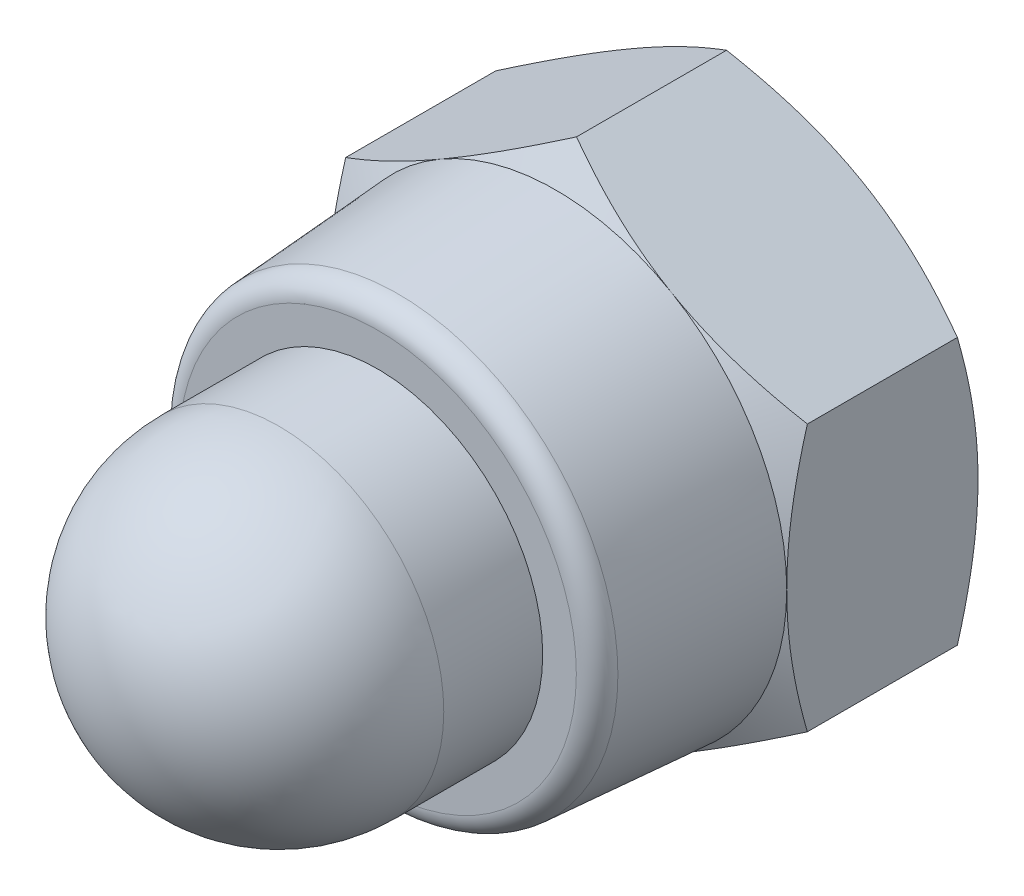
ISO-10303-21;
HEADER;
FILE_DESCRIPTION(('STEP AP214'),'2;1');
FILE_NAME('part.step','',(''),(''),'','','');
FILE_SCHEMA(('AUTOMOTIVE_DESIGN { 1 0 10303 214 1 1 1 1 }'));
ENDSEC;
DATA;
#1=APPLICATION_CONTEXT('core data for automotive mechanical design processes');
#2=APPLICATION_PROTOCOL_DEFINITION('international standard','automotive_design',2000,#1);
#3=PRODUCT_CONTEXT('',#1,'mechanical');
#4=PRODUCT('Part','Part','',(#3));
#5=PRODUCT_RELATED_PRODUCT_CATEGORY('part','',(#4));
#6=PRODUCT_DEFINITION_FORMATION('','',#4);
#7=PRODUCT_DEFINITION_CONTEXT('part definition',#1,'design');
#8=PRODUCT_DEFINITION('design','',#6,#7);
#9=PRODUCT_DEFINITION_SHAPE('','',#8);
#10=(LENGTH_UNIT() NAMED_UNIT(*) SI_UNIT(.MILLI.,.METRE.));
#11=(NAMED_UNIT(*) PLANE_ANGLE_UNIT() SI_UNIT($,.RADIAN.));
#12=(NAMED_UNIT(*) SI_UNIT($,.STERADIAN.) SOLID_ANGLE_UNIT());
#13=UNCERTAINTY_MEASURE_WITH_UNIT(LENGTH_MEASURE(1.E-05),#10,'distance_accuracy_value','');
#14=(GEOMETRIC_REPRESENTATION_CONTEXT(3) GLOBAL_UNCERTAINTY_ASSIGNED_CONTEXT((#13)) GLOBAL_UNIT_ASSIGNED_CONTEXT((#10,
#11,#12)) REPRESENTATION_CONTEXT('',''));
#15=CARTESIAN_POINT('',(0.,0.,0.));
#16=DIRECTION('',(0.,0.,1.));
#17=DIRECTION('',(1.,0.,0.));
#18=AXIS2_PLACEMENT_3D('',#15,#16,#17);
#19=CARTESIAN_POINT('',(0.,0.,-2.9));
#20=DIRECTION('',(0.,0.,1.));
#21=DIRECTION('',(1.,0.,0.));
#22=AXIS2_PLACEMENT_3D('',#19,#20,#21);
#23=CYLINDRICAL_SURFACE('',#22,1.65);
#24=CARTESIAN_POINT('',(0.,0.,4.2));
#25=DIRECTION('',(0.,0.,1.));
#26=DIRECTION('',(1.,0.,0.));
#27=AXIS2_PLACEMENT_3D('',#24,#25,#26);
#28=CIRCLE('',#27,1.65);
#29=CARTESIAN_POINT('',(1.65,0.,4.2));
#30=VERTEX_POINT('',#29);
#31=EDGE_CURVE('E262',#30,#30,#28,.T.);
#32=ORIENTED_EDGE('',*,*,#31,.T.);
#33=EDGE_LOOP('',(#32));
#34=FACE_BOUND('',#33,.T.);
#35=CARTESIAN_POINT('',(0.,0.,-2.6295273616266));
#36=DIRECTION('',(0.,0.,-1.));
#37=DIRECTION('',(-1.,0.,0.));
#38=AXIS2_PLACEMENT_3D('',#35,#36,#37);
#39=CIRCLE('',#38,1.65);
#40=CARTESIAN_POINT('',(-1.65,0.,-2.6295273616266));
#41=VERTEX_POINT('',#40);
#42=EDGE_CURVE('E41',#41,#41,#39,.F.);
#43=ORIENTED_EDGE('',*,*,#42,.F.);
#44=EDGE_LOOP('',(#43));
#45=FACE_BOUND('',#44,.T.);
#46=ADVANCED_FACE('F36',(#34,#45),#23,.F.);
#47=CARTESIAN_POINT('',(0.,4.04145188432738,-2.9));
#48=DIRECTION('',(-0.500000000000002,0.866025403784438,0.));
#49=DIRECTION('',(-0.866025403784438,-0.500000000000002,0.));
#50=AXIS2_PLACEMENT_3D('',#47,#48,#49);
#51=PLANE('',#50);
#52=DIRECTION('',(0.,0.,1.));
#53=VECTOR('',#52,1.);
#54=CARTESIAN_POINT('',(-3.5,2.02072594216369,-2.9));
#55=LINE('',#54,#53);
#56=CARTESIAN_POINT('',(-3.5,2.0207259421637,-2.58739260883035));
#57=VERTEX_POINT('',#56);
#58=CARTESIAN_POINT('',(-3.5,2.02072594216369,-0.312607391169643));
#59=VERTEX_POINT('',#58);
#60=EDGE_CURVE('E250',#57,#59,#55,.T.);
#61=ORIENTED_EDGE('',*,*,#60,.T.);
#62=CARTESIAN_POINT('',(-3.5002,2.02061047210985,-0.312674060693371));
#63=CARTESIAN_POINT('',(-3.34639282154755,2.10941108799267,-0.261385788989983));
#64=CARTESIAN_POINT('',(-3.19125798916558,2.19897822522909,-0.214740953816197));
#65=CARTESIAN_POINT('',(-2.87830199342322,2.37966345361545,-0.133321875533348));
#66=CARTESIAN_POINT('',(-2.7204752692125,2.47078475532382,-0.0985764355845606));
#67=CARTESIAN_POINT('',(-2.40677778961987,2.65189807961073,-0.0444900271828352));
#68=CARTESIAN_POINT('',(-2.25095530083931,2.74186223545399,-0.0247890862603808));
#69=CARTESIAN_POINT('',(-1.93857711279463,2.92221386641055,-0.00127013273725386));
#70=CARTESIAN_POINT('',(-1.78202254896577,3.01260068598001,0.00256735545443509));
#71=CARTESIAN_POINT('',(-1.48949078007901,3.1814939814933,-0.00541530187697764));
#72=CARTESIAN_POINT('',(-1.3534697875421,3.26002573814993,-0.0152754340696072));
#73=CARTESIAN_POINT('',(-1.08231397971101,3.41657761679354,-0.046526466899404));
#74=CARTESIAN_POINT('',(-0.947180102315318,3.49459719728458,-0.0679280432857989));
#75=CARTESIAN_POINT('',(-0.675465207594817,3.65147186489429,-0.121430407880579));
#76=CARTESIAN_POINT('',(-0.538918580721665,3.73030709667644,-0.153757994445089));
#77=CARTESIAN_POINT('',(-0.267861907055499,3.88680174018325,-0.227128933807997));
#78=CARTESIAN_POINT('',(-0.133348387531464,3.96446315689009,-0.26815504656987));
#79=CARTESIAN_POINT('',(0.000199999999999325,4.04156735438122,-0.312674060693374));
#80=B_SPLINE_CURVE_WITH_KNOTS('',3,(#62,#63,#64,#65,#66,#67,#68,#69,#70,#71,#72,#73,#74,#75,#76,
#77,#78,#79),.UNSPECIFIED.,.F.,.F.,(4,2,2,2,2,2,2,2,4),(0.,0.554793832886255,1.11092123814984,
1.65328467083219,2.19498204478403,2.6666513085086,3.13875761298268,3.6213361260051,
4.10296698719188),.UNSPECIFIED.);
#81=CARTESIAN_POINT('',(-1.75000000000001,3.03108891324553,0.));
#82=VERTEX_POINT('',#81);
#83=EDGE_CURVE('E63',#59,#82,#80,.T.);
#84=ORIENTED_EDGE('',*,*,#83,.T.);
#85=CARTESIAN_POINT('',(0.,4.04145188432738,-0.312607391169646));
#86=VERTEX_POINT('',#85);
#87=EDGE_CURVE('E142',#82,#86,#80,.T.);
#88=ORIENTED_EDGE('',*,*,#87,.T.);
#89=DIRECTION('',(0.,0.,1.));
#90=VECTOR('',#89,1.);
#91=CARTESIAN_POINT('',(0.,4.04145188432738,-2.9));
#92=LINE('',#91,#90);
#93=CARTESIAN_POINT('',(0.,4.04145188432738,-2.58739260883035));
#94=VERTEX_POINT('',#93);
#95=EDGE_CURVE('E139',#94,#86,#92,.T.);
#96=ORIENTED_EDGE('',*,*,#95,.F.);
#97=CARTESIAN_POINT('',(-3.5002,2.02061047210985,-2.58732593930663));
#98=CARTESIAN_POINT('',(-3.34639282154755,2.10941108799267,-2.63861421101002));
#99=CARTESIAN_POINT('',(-3.19125798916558,2.19897822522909,-2.6852590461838));
#100=CARTESIAN_POINT('',(-2.87830199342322,2.37966345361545,-2.76667812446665));
#101=CARTESIAN_POINT('',(-2.7204752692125,2.47078475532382,-2.80142356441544));
#102=CARTESIAN_POINT('',(-2.40677778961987,2.65189807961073,-2.85550997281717));
#103=CARTESIAN_POINT('',(-2.25095530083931,2.74186223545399,-2.87521091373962));
#104=CARTESIAN_POINT('',(-1.93857711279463,2.92221386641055,-2.89872986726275));
#105=CARTESIAN_POINT('',(-1.78202254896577,3.01260068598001,-2.90256735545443));
#106=CARTESIAN_POINT('',(-1.48949078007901,3.1814939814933,-2.89458469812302));
#107=CARTESIAN_POINT('',(-1.3534697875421,3.26002573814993,-2.88472456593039));
#108=CARTESIAN_POINT('',(-1.08231397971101,3.41657761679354,-2.8534735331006));
#109=CARTESIAN_POINT('',(-0.947180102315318,3.49459719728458,-2.8320719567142));
#110=CARTESIAN_POINT('',(-0.675465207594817,3.65147186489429,-2.77856959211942));
#111=CARTESIAN_POINT('',(-0.538918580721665,3.73030709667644,-2.74624200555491));
#112=CARTESIAN_POINT('',(-0.267861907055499,3.88680174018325,-2.672871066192));
#113=CARTESIAN_POINT('',(-0.133348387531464,3.96446315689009,-2.63184495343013));
#114=CARTESIAN_POINT('',(0.00019999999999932,4.04156735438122,-2.58732593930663));
#115=B_SPLINE_CURVE_WITH_KNOTS('',3,(#97,#98,#99,#100,#101,#102,#103,#104,#105,#106,#107,#108,
#109,#110,#111,#112,#113,#114),.UNSPECIFIED.,.F.,.F.,(4,2,2,2,2,2,2,2,4),(0.,0.554793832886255,
1.11092123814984,1.65328467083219,2.19498204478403,2.6666513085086,3.13875761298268,
3.6213361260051,4.10296698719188),.UNSPECIFIED.);
#116=CARTESIAN_POINT('',(-1.75000000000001,3.03108891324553,-2.9));
#117=VERTEX_POINT('',#116);
#118=EDGE_CURVE('E253',#117,#94,#115,.T.);
#119=ORIENTED_EDGE('',*,*,#118,.F.);
#120=EDGE_CURVE('E232',#57,#117,#115,.T.);
#121=ORIENTED_EDGE('',*,*,#120,.F.);
#122=EDGE_LOOP('',(#61,#84,#88,#96,#119,#121));
#123=FACE_BOUND('',#122,.T.);
#124=ADVANCED_FACE('F38',(#123),#51,.T.);
#125=CARTESIAN_POINT('',(3.5,2.02072594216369,-2.9));
#126=DIRECTION('',(0.500000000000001,0.866025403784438,0.));
#127=DIRECTION('',(-0.866025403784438,0.500000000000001,0.));
#128=AXIS2_PLACEMENT_3D('',#125,#126,#127);
#129=PLANE('',#128);
#130=ORIENTED_EDGE('',*,*,#95,.T.);
#131=CARTESIAN_POINT('',(-0.000200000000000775,4.04156735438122,-0.312674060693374));
#132=CARTESIAN_POINT('',(0.153607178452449,3.9527667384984,-0.261385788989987));
#133=CARTESIAN_POINT('',(0.308742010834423,3.86319960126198,-0.2147409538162));
#134=CARTESIAN_POINT('',(0.621698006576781,3.68251437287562,-0.13332187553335));
#135=CARTESIAN_POINT('',(0.779524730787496,3.59139307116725,-0.0985764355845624));
#136=CARTESIAN_POINT('',(1.09322221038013,3.41027974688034,-0.0444900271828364));
#137=CARTESIAN_POINT('',(1.24904469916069,3.32031559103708,-0.0247890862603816));
#138=CARTESIAN_POINT('',(1.56142288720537,3.13996396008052,-0.00127013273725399));
#139=CARTESIAN_POINT('',(1.71797745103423,3.04957714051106,0.0025673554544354));
#140=CARTESIAN_POINT('',(2.01050921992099,2.88068384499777,-0.00541530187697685));
#141=CARTESIAN_POINT('',(2.14653021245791,2.80215208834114,-0.0152754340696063));
#142=CARTESIAN_POINT('',(2.417686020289,2.64560020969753,-0.0465264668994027));
#143=CARTESIAN_POINT('',(2.55281989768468,2.56758062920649,-0.0679280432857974));
#144=CARTESIAN_POINT('',(2.82453479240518,2.41070596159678,-0.121430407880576));
#145=CARTESIAN_POINT('',(2.96108141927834,2.33187072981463,-0.153757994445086));
#146=CARTESIAN_POINT('',(3.2321380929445,2.17537608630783,-0.227128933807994));
#147=CARTESIAN_POINT('',(3.36665161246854,2.09771466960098,-0.268155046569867));
#148=CARTESIAN_POINT('',(3.5002,2.02061047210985,-0.312674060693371));
#149=B_SPLINE_CURVE_WITH_KNOTS('',3,(#131,#132,#133,#134,#135,#136,#137,#138,#139,#140,#141,
#142,#143,#144,#145,#146,#147,#148),.UNSPECIFIED.,.F.,.F.,(4,2,2,2,2,2,2,2,4),(0.,
0.554793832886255,1.11092123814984,1.65328467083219,2.19498204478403,2.6666513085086,
3.13875761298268,3.6213361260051,4.10296698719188),.UNSPECIFIED.);
#150=CARTESIAN_POINT('',(1.75,3.03108891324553,0.));
#151=VERTEX_POINT('',#150);
#152=EDGE_CURVE('E131',#86,#151,#149,.T.);
#153=ORIENTED_EDGE('',*,*,#152,.T.);
#154=CARTESIAN_POINT('',(3.5,2.0207259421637,-0.312607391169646));
#155=VERTEX_POINT('',#154);
#156=EDGE_CURVE('E135',#151,#155,#149,.T.);
#157=ORIENTED_EDGE('',*,*,#156,.T.);
#158=DIRECTION('',(0.,0.,1.));
#159=VECTOR('',#158,1.);
#160=CARTESIAN_POINT('',(3.5,2.02072594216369,-2.9));
#161=LINE('',#160,#159);
#162=CARTESIAN_POINT('',(3.5,2.0207259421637,-2.58739260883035));
#163=VERTEX_POINT('',#162);
#164=EDGE_CURVE('E239',#163,#155,#161,.T.);
#165=ORIENTED_EDGE('',*,*,#164,.F.);
#166=CARTESIAN_POINT('',(-0.000200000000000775,4.04156735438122,-2.58732593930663));
#167=CARTESIAN_POINT('',(0.153607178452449,3.9527667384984,-2.63861421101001));
#168=CARTESIAN_POINT('',(0.308742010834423,3.86319960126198,-2.6852590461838));
#169=CARTESIAN_POINT('',(0.621698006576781,3.68251437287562,-2.76667812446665));
#170=CARTESIAN_POINT('',(0.779524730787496,3.59139307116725,-2.80142356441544));
#171=CARTESIAN_POINT('',(1.09322221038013,3.41027974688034,-2.85550997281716));
#172=CARTESIAN_POINT('',(1.24904469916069,3.32031559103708,-2.87521091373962));
#173=CARTESIAN_POINT('',(1.56142288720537,3.13996396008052,-2.89872986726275));
#174=CARTESIAN_POINT('',(1.71797745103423,3.04957714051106,-2.90256735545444));
#175=CARTESIAN_POINT('',(2.01050921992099,2.88068384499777,-2.89458469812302));
#176=CARTESIAN_POINT('',(2.14653021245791,2.80215208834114,-2.88472456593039));
#177=CARTESIAN_POINT('',(2.417686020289,2.64560020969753,-2.8534735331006));
#178=CARTESIAN_POINT('',(2.55281989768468,2.56758062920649,-2.8320719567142));
#179=CARTESIAN_POINT('',(2.82453479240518,2.41070596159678,-2.77856959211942));
#180=CARTESIAN_POINT('',(2.96108141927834,2.33187072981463,-2.74624200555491));
#181=CARTESIAN_POINT('',(3.2321380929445,2.17537608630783,-2.67287106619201));
#182=CARTESIAN_POINT('',(3.36665161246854,2.09771466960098,-2.63184495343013));
#183=CARTESIAN_POINT('',(3.5002,2.02061047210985,-2.58732593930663));
#184=B_SPLINE_CURVE_WITH_KNOTS('',3,(#166,#167,#168,#169,#170,#171,#172,#173,#174,#175,#176,
#177,#178,#179,#180,#181,#182,#183),.UNSPECIFIED.,.F.,.F.,(4,2,2,2,2,2,2,2,4),(0.,
0.554793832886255,1.11092123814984,1.65328467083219,2.19498204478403,2.6666513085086,
3.13875761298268,3.6213361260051,4.10296698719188),.UNSPECIFIED.);
#185=CARTESIAN_POINT('',(1.75,3.03108891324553,-2.9));
#186=VERTEX_POINT('',#185);
#187=EDGE_CURVE('E224',#186,#163,#184,.T.);
#188=ORIENTED_EDGE('',*,*,#187,.F.);
#189=EDGE_CURVE('E230',#94,#186,#184,.T.);
#190=ORIENTED_EDGE('',*,*,#189,.F.);
#191=EDGE_LOOP('',(#130,#153,#157,#165,#188,#190));
#192=FACE_BOUND('',#191,.T.);
#193=ADVANCED_FACE('F133',(#192),#129,.T.);
#194=CARTESIAN_POINT('',(3.5,2.02072594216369,-2.9));
#195=DIRECTION('',(-1.,0.,0.));
#196=DIRECTION('',(0.,0.,1.));
#197=AXIS2_PLACEMENT_3D('',#194,#195,#196);
#198=PLANE('',#197);
#199=CARTESIAN_POINT('',(3.5,-5.35926299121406,-1.67484346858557));
#200=CARTESIAN_POINT('',(3.5,-5.20559319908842,-1.60058173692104));
#201=CARTESIAN_POINT('',(3.5,-5.05156008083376,-1.52705822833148));
#202=CARTESIAN_POINT('',(3.5,-4.74257074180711,-1.38190950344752));
#203=CARTESIAN_POINT('',(3.5,-4.58761436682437,-1.31028461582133));
#204=CARTESIAN_POINT('',(3.5,-4.27574500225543,-1.16897765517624));
#205=CARTESIAN_POINT('',(3.5,-4.11882589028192,-1.09930904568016));
#206=CARTESIAN_POINT('',(3.5,-3.80369792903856,-0.962964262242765));
#207=CARTESIAN_POINT('',(3.5,-3.64548914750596,-0.896287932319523));
#208=CARTESIAN_POINT('',(3.5,-3.32556618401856,-0.765931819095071));
#209=CARTESIAN_POINT('',(3.5,-3.16383281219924,-0.702298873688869));
#210=CARTESIAN_POINT('',(3.5,-2.83845840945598,-0.580016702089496));
#211=CARTESIAN_POINT('',(3.5,-2.67481716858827,-0.521368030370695));
#212=CARTESIAN_POINT('',(3.5,-2.3457027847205,-0.410630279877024));
#213=CARTESIAN_POINT('',(3.5,-2.18023438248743,-0.35852725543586));
#214=CARTESIAN_POINT('',(3.5,-1.8469452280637,-0.262572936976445));
#215=CARTESIAN_POINT('',(3.5,-1.67912523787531,-0.21871903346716));
#216=CARTESIAN_POINT('',(3.5,-1.34101828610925,-0.141391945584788));
#217=CARTESIAN_POINT('',(3.5,-1.17073068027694,-0.107921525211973));
#218=CARTESIAN_POINT('',(3.5,-0.828102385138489,-0.0536149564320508));
#219=CARTESIAN_POINT('',(3.5,-0.655761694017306,-0.0327788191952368));
#220=CARTESIAN_POINT('',(3.5,-0.311020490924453,-0.00558408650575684));
#221=CARTESIAN_POINT('',(3.5,-0.138627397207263,0.000866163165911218));
#222=CARTESIAN_POINT('',(3.5,0.206038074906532,-0.00105355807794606));
#223=CARTESIAN_POINT('',(3.5,0.378310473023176,-0.00941968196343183));
#224=CARTESIAN_POINT('',(3.5,0.672490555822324,-0.0357688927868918));
#225=CARTESIAN_POINT('',(3.5,0.794722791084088,-0.0503206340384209));
#226=CARTESIAN_POINT('',(3.5,1.0382430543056,-0.085936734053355));
#227=CARTESIAN_POINT('',(3.5,1.15953093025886,-0.10700211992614));
#228=CARTESIAN_POINT('',(3.5,1.52187914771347,-0.178863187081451));
#229=CARTESIAN_POINT('',(3.5,1.76124104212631,-0.238305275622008));
#230=CARTESIAN_POINT('',(3.5,2.11940971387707,-0.340826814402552));
#231=CARTESIAN_POINT('',(3.5,2.24008344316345,-0.377749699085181));
#232=CARTESIAN_POINT('',(3.5,2.48017139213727,-0.455249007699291));
#233=CARTESIAN_POINT('',(3.5,2.59958641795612,-0.495822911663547));
#234=CARTESIAN_POINT('',(3.5,2.83665760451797,-0.579779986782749));
#235=CARTESIAN_POINT('',(3.5,2.95431988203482,-0.623146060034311));
#236=CARTESIAN_POINT('',(3.5,3.18873153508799,-0.712423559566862));
#237=CARTESIAN_POINT('',(3.5,3.30548051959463,-0.758336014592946));
#238=CARTESIAN_POINT('',(3.5,3.42180736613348,-0.805270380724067));
#239=B_SPLINE_CURVE_WITH_KNOTS('',3,(#199,#200,#201,#202,#203,#204,#205,#206,#207,#208,#209,
#210,#211,#212,#213,#214,#215,#216,#217,#218,#219,#220,#221,#222,#223,#224,#225,#226,#227,#228,
#229,#230,#231,#232,#233,#234,#235,#236,#237,#238),.UNSPECIFIED.,.F.,.F.,(4,2,2,2,2,2,2,2,2,2,2,
2,2,2,2,2,2,2,2,4),(0.,0.512025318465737,1.02413870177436,1.53918270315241,2.05419982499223,
2.57553975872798,3.09693761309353,3.617205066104,4.13730766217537,4.65754858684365,
5.17778997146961,5.69470725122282,6.21149033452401,6.58059623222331,6.94976036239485,
7.68863804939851,8.06719621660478,8.4454950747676,8.82166461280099,9.1979872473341),.UNSPECIFIED.);
#240=CARTESIAN_POINT('',(3.5,-2.0207259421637,-0.312607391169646));
#241=VERTEX_POINT('',#240);
#242=CARTESIAN_POINT('',(3.5,0.,0.));
#243=VERTEX_POINT('',#242);
#244=EDGE_CURVE('E200',#241,#243,#239,.T.);
#245=ORIENTED_EDGE('',*,*,#244,.F.);
#246=DIRECTION('',(0.,0.,1.));
#247=VECTOR('',#246,1.);
#248=CARTESIAN_POINT('',(3.5,-2.0207259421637,-2.9));
#249=LINE('',#248,#247);
#250=CARTESIAN_POINT('',(3.5,-2.0207259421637,-2.58739260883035));
#251=VERTEX_POINT('',#250);
#252=EDGE_CURVE('E241',#251,#241,#249,.T.);
#253=ORIENTED_EDGE('',*,*,#252,.F.);
#254=CARTESIAN_POINT('',(3.5,-5.35926299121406,-1.22515653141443));
#255=CARTESIAN_POINT('',(3.5,-5.20559319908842,-1.29941826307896));
#256=CARTESIAN_POINT('',(3.5,-5.05156008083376,-1.37294177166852));
#257=CARTESIAN_POINT('',(3.5,-4.74257074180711,-1.51809049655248));
#258=CARTESIAN_POINT('',(3.5,-4.58761436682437,-1.58971538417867));
#259=CARTESIAN_POINT('',(3.5,-4.27574500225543,-1.73102234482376));
#260=CARTESIAN_POINT('',(3.5,-4.11882589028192,-1.80069095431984));
#261=CARTESIAN_POINT('',(3.5,-3.80369792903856,-1.93703573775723));
#262=CARTESIAN_POINT('',(3.5,-3.64548914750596,-2.00371206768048));
#263=CARTESIAN_POINT('',(3.5,-3.32556618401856,-2.13406818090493));
#264=CARTESIAN_POINT('',(3.5,-3.16383281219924,-2.19770112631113));
#265=CARTESIAN_POINT('',(3.5,-2.83845840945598,-2.3199832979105));
#266=CARTESIAN_POINT('',(3.5,-2.67481716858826,-2.37863196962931));
#267=CARTESIAN_POINT('',(3.5,-2.3457027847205,-2.48936972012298));
#268=CARTESIAN_POINT('',(3.5,-2.18023438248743,-2.54147274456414));
#269=CARTESIAN_POINT('',(3.5,-1.8469452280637,-2.63742706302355));
#270=CARTESIAN_POINT('',(3.5,-1.67912523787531,-2.68128096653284));
#271=CARTESIAN_POINT('',(3.5,-1.34101828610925,-2.75860805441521));
#272=CARTESIAN_POINT('',(3.5,-1.17073068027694,-2.79207847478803));
#273=CARTESIAN_POINT('',(3.5,-0.828102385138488,-2.84638504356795));
#274=CARTESIAN_POINT('',(3.5,-0.655761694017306,-2.86722118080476));
#275=CARTESIAN_POINT('',(3.5,-0.311020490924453,-2.89441591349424));
#276=CARTESIAN_POINT('',(3.5,-0.138627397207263,-2.90086616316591));
#277=CARTESIAN_POINT('',(3.5,0.206038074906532,-2.89894644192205));
#278=CARTESIAN_POINT('',(3.5,0.378310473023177,-2.89058031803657));
#279=CARTESIAN_POINT('',(3.5,0.672490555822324,-2.86423110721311));
#280=CARTESIAN_POINT('',(3.5,0.794722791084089,-2.84967936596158));
#281=CARTESIAN_POINT('',(3.5,1.0382430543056,-2.81406326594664));
#282=CARTESIAN_POINT('',(3.5,1.15953093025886,-2.79299788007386));
#283=CARTESIAN_POINT('',(3.5,1.52187914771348,-2.72113681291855));
#284=CARTESIAN_POINT('',(3.5,1.76124104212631,-2.66169472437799));
#285=CARTESIAN_POINT('',(3.5,2.11940971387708,-2.55917318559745));
#286=CARTESIAN_POINT('',(3.5,2.24008344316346,-2.52225030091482));
#287=CARTESIAN_POINT('',(3.5,2.48017139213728,-2.44475099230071));
#288=CARTESIAN_POINT('',(3.5,2.59958641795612,-2.40417708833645));
#289=CARTESIAN_POINT('',(3.5,2.83665760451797,-2.32022001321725));
#290=CARTESIAN_POINT('',(3.5,2.95431988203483,-2.27685393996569));
#291=CARTESIAN_POINT('',(3.5,3.18873153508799,-2.18757644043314));
#292=CARTESIAN_POINT('',(3.5,3.30548051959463,-2.14166398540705));
#293=CARTESIAN_POINT('',(3.5,3.42180736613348,-2.09472961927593));
#294=B_SPLINE_CURVE_WITH_KNOTS('',3,(#254,#255,#256,#257,#258,#259,#260,#261,#262,#263,#264,
#265,#266,#267,#268,#269,#270,#271,#272,#273,#274,#275,#276,#277,#278,#279,#280,#281,#282,#283,
#284,#285,#286,#287,#288,#289,#290,#291,#292,#293),.UNSPECIFIED.,.F.,.F.,(4,2,2,2,2,2,2,2,2,2,2,
2,2,2,2,2,2,2,2,4),(0.,0.512025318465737,1.02413870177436,1.53918270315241,2.05419982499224,
2.57553975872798,3.09693761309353,3.61720506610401,4.13730766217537,4.65754858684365,
5.17778997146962,5.69470725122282,6.21149033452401,6.58059623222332,6.94976036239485,
7.68863804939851,8.06719621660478,8.4454950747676,8.82166461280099,9.1979872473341),.UNSPECIFIED.);
#295=CARTESIAN_POINT('',(3.5,0.,-2.9));
#296=VERTEX_POINT('',#295);
#297=EDGE_CURVE('E539',#251,#296,#294,.T.);
#298=ORIENTED_EDGE('',*,*,#297,.T.);
#299=EDGE_CURVE('E231',#296,#163,#294,.T.);
#300=ORIENTED_EDGE('',*,*,#299,.T.);
#301=ORIENTED_EDGE('',*,*,#164,.T.);
#302=EDGE_CURVE('E149',#243,#155,#239,.T.);
#303=ORIENTED_EDGE('',*,*,#302,.F.);
#304=EDGE_LOOP('',(#245,#253,#298,#300,#301,#303));
#305=FACE_BOUND('',#304,.T.);
#306=ADVANCED_FACE('F219',(#305),#198,.F.);
#307=CARTESIAN_POINT('',(0.,-4.0414518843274,-2.9));
#308=DIRECTION('',(0.500000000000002,-0.866025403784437,0.));
#309=DIRECTION('',(0.866025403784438,0.500000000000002,0.));
#310=AXIS2_PLACEMENT_3D('',#307,#308,#309);
#311=PLANE('',#310);
#312=ORIENTED_EDGE('',*,*,#252,.T.);
#313=CARTESIAN_POINT('',(3.5002,-2.02061047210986,-0.312674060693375));
#314=CARTESIAN_POINT('',(3.34639282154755,-2.10941108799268,-0.261385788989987));
#315=CARTESIAN_POINT('',(3.19125798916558,-2.1989782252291,-0.214740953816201));
#316=CARTESIAN_POINT('',(2.87830199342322,-2.37966345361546,-0.133321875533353));
#317=CARTESIAN_POINT('',(2.7204752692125,-2.47078475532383,-0.0985764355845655));
#318=CARTESIAN_POINT('',(2.40677778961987,-2.65189807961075,-0.0444900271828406));
#319=CARTESIAN_POINT('',(2.25095530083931,-2.741862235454,-0.0247890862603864));
#320=CARTESIAN_POINT('',(1.93857711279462,-2.92221386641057,-0.00127013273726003));
#321=CARTESIAN_POINT('',(1.78202254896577,-3.01260068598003,0.0025673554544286));
#322=CARTESIAN_POINT('',(1.48949078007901,-3.18149398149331,-0.00541530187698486));
#323=CARTESIAN_POINT('',(1.35346978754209,-3.26002573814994,-0.0152754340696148));
#324=CARTESIAN_POINT('',(1.082313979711,-3.41657761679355,-0.0465264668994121));
#325=CARTESIAN_POINT('',(0.947180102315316,-3.49459719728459,-0.0679280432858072));
#326=CARTESIAN_POINT('',(0.675465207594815,-3.6514718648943,-0.121430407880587));
#327=CARTESIAN_POINT('',(0.538918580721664,-3.73030709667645,-0.153757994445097));
#328=CARTESIAN_POINT('',(0.267861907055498,-3.88680174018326,-0.227128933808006));
#329=CARTESIAN_POINT('',(0.133348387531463,-3.96446315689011,-0.268155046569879));
#330=CARTESIAN_POINT('',(-0.000200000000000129,-4.04156735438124,-0.312674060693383));
#331=B_SPLINE_CURVE_WITH_KNOTS('',3,(#313,#314,#315,#316,#317,#318,#319,#320,#321,#322,#323,
#324,#325,#326,#327,#328,#329,#330),.UNSPECIFIED.,.F.,.F.,(4,2,2,2,2,2,2,2,4),(0.,
0.554793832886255,1.11092123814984,1.65328467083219,2.19498204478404,2.6666513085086,
3.13875761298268,3.6213361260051,4.10296698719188),.UNSPECIFIED.);
#332=CARTESIAN_POINT('',(1.75000000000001,-3.03108891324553,0.));
#333=VERTEX_POINT('',#332);
#334=EDGE_CURVE('E585',#241,#333,#331,.T.);
#335=ORIENTED_EDGE('',*,*,#334,.T.);
#336=CARTESIAN_POINT('',(0.,-4.04145188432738,-0.312607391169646));
#337=VERTEX_POINT('',#336);
#338=EDGE_CURVE('E194',#333,#337,#331,.T.);
#339=ORIENTED_EDGE('',*,*,#338,.T.);
#340=DIRECTION('',(0.,0.,1.));
#341=VECTOR('',#340,1.);
#342=CARTESIAN_POINT('',(0.,-4.0414518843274,-2.9));
#343=LINE('',#342,#341);
#344=CARTESIAN_POINT('',(0.,-4.04145188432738,-2.58739260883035));
#345=VERTEX_POINT('',#344);
#346=EDGE_CURVE('E244',#345,#337,#343,.T.);
#347=ORIENTED_EDGE('',*,*,#346,.F.);
#348=CARTESIAN_POINT('',(3.5002,-2.02061047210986,-2.58732593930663));
#349=CARTESIAN_POINT('',(3.34639282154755,-2.10941108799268,-2.63861421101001));
#350=CARTESIAN_POINT('',(3.19125798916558,-2.1989782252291,-2.6852590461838));
#351=CARTESIAN_POINT('',(2.87830199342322,-2.37966345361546,-2.76667812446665));
#352=CARTESIAN_POINT('',(2.7204752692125,-2.47078475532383,-2.80142356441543));
#353=CARTESIAN_POINT('',(2.40677778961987,-2.65189807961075,-2.85550997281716));
#354=CARTESIAN_POINT('',(2.25095530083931,-2.741862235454,-2.87521091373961));
#355=CARTESIAN_POINT('',(1.93857711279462,-2.92221386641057,-2.89872986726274));
#356=CARTESIAN_POINT('',(1.78202254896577,-3.01260068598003,-2.90256735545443));
#357=CARTESIAN_POINT('',(1.48949078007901,-3.18149398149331,-2.89458469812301));
#358=CARTESIAN_POINT('',(1.35346978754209,-3.26002573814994,-2.88472456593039));
#359=CARTESIAN_POINT('',(1.082313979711,-3.41657761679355,-2.85347353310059));
#360=CARTESIAN_POINT('',(0.947180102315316,-3.49459719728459,-2.83207195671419));
#361=CARTESIAN_POINT('',(0.675465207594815,-3.6514718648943,-2.77856959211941));
#362=CARTESIAN_POINT('',(0.538918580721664,-3.73030709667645,-2.7462420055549));
#363=CARTESIAN_POINT('',(0.267861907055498,-3.88680174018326,-2.67287106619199));
#364=CARTESIAN_POINT('',(0.133348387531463,-3.96446315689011,-2.63184495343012));
#365=CARTESIAN_POINT('',(-0.000200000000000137,-4.04156735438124,-2.58732593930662));
#366=B_SPLINE_CURVE_WITH_KNOTS('',3,(#348,#349,#350,#351,#352,#353,#354,#355,#356,#357,#358,
#359,#360,#361,#362,#363,#364,#365),.UNSPECIFIED.,.F.,.F.,(4,2,2,2,2,2,2,2,4),(0.,
0.554793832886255,1.11092123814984,1.65328467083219,2.19498204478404,2.6666513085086,
3.13875761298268,3.6213361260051,4.10296698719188),.UNSPECIFIED.);
#367=CARTESIAN_POINT('',(1.75000000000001,-3.03108891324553,-2.9));
#368=VERTEX_POINT('',#367);
#369=EDGE_CURVE('E545',#368,#345,#366,.T.);
#370=ORIENTED_EDGE('',*,*,#369,.F.);
#371=EDGE_CURVE('E544',#251,#368,#366,.T.);
#372=ORIENTED_EDGE('',*,*,#371,.F.);
#373=EDGE_LOOP('',(#312,#335,#339,#347,#370,#372));
#374=FACE_BOUND('',#373,.T.);
#375=ADVANCED_FACE('F429',(#374),#311,.T.);
#376=CARTESIAN_POINT('',(-3.5,-2.0207259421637,-2.9));
#377=DIRECTION('',(-0.500000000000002,-0.866025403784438,0.));
#378=DIRECTION('',(0.866025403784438,-0.500000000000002,0.));
#379=AXIS2_PLACEMENT_3D('',#376,#377,#378);
#380=PLANE('',#379);
#381=ORIENTED_EDGE('',*,*,#346,.T.);
#382=CARTESIAN_POINT('',(0.00020000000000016,-4.04156735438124,-0.312674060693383));
#383=CARTESIAN_POINT('',(-0.15360717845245,-3.95276673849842,-0.261385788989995));
#384=CARTESIAN_POINT('',(-0.308742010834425,-3.863199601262,-0.214740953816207));
#385=CARTESIAN_POINT('',(-0.621698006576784,-3.68251437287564,-0.133321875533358));
#386=CARTESIAN_POINT('',(-0.779524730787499,-3.59139307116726,-0.09857643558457));
#387=CARTESIAN_POINT('',(-1.09322221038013,-3.41027974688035,-0.0444900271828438));
#388=CARTESIAN_POINT('',(-1.2490446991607,-3.32031559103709,-0.0247890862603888));
#389=CARTESIAN_POINT('',(-1.56142288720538,-3.13996396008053,-0.00127013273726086));
#390=CARTESIAN_POINT('',(-1.71797745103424,-3.04957714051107,0.00256735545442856));
#391=CARTESIAN_POINT('',(-2.010509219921,-2.88068384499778,-0.00541530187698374));
#392=CARTESIAN_POINT('',(-2.14653021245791,-2.80215208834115,-0.0152754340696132));
#393=CARTESIAN_POINT('',(-2.417686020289,-2.64560020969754,-0.0465264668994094));
#394=CARTESIAN_POINT('',(-2.55281989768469,-2.56758062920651,-0.0679280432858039));
#395=CARTESIAN_POINT('',(-2.82453479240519,-2.41070596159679,-0.121430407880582));
#396=CARTESIAN_POINT('',(-2.96108141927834,-2.33187072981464,-0.153757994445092));
#397=CARTESIAN_POINT('',(-3.2321380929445,-2.17537608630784,-0.227128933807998));
#398=CARTESIAN_POINT('',(-3.36665161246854,-2.09771466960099,-0.26815504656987));
#399=CARTESIAN_POINT('',(-3.5002,-2.02061047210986,-0.312674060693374));
#400=B_SPLINE_CURVE_WITH_KNOTS('',3,(#382,#383,#384,#385,#386,#387,#388,#389,#390,#391,#392,
#393,#394,#395,#396,#397,#398,#399),.UNSPECIFIED.,.F.,.F.,(4,2,2,2,2,2,2,2,4),(0.,
0.554793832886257,1.11092123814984,1.6532846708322,2.19498204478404,2.66665130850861,
3.13875761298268,3.6213361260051,4.10296698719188),.UNSPECIFIED.);
#401=CARTESIAN_POINT('',(-1.75000000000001,-3.03108891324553,0.));
#402=VERTEX_POINT('',#401);
#403=EDGE_CURVE('E580',#337,#402,#400,.T.);
#404=ORIENTED_EDGE('',*,*,#403,.T.);
#405=CARTESIAN_POINT('',(-3.5,-2.0207259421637,-0.312607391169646));
#406=VERTEX_POINT('',#405);
#407=EDGE_CURVE('E168',#402,#406,#400,.T.);
#408=ORIENTED_EDGE('',*,*,#407,.T.);
#409=DIRECTION('',(0.,0.,1.));
#410=VECTOR('',#409,1.);
#411=CARTESIAN_POINT('',(-3.5,-2.0207259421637,-2.9));
#412=LINE('',#411,#410);
#413=CARTESIAN_POINT('',(-3.5,-2.0207259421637,-2.58739260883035));
#414=VERTEX_POINT('',#413);
#415=EDGE_CURVE('E247',#414,#406,#412,.T.);
#416=ORIENTED_EDGE('',*,*,#415,.F.);
#417=CARTESIAN_POINT('',(0.00020000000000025,-4.04156735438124,-2.58732593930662));
#418=CARTESIAN_POINT('',(-0.15360717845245,-3.95276673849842,-2.63861421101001));
#419=CARTESIAN_POINT('',(-0.308742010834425,-3.863199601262,-2.68525904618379));
#420=CARTESIAN_POINT('',(-0.621698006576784,-3.68251437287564,-2.76667812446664));
#421=CARTESIAN_POINT('',(-0.779524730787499,-3.59139307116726,-2.80142356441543));
#422=CARTESIAN_POINT('',(-1.09322221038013,-3.41027974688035,-2.85550997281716));
#423=CARTESIAN_POINT('',(-1.2490446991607,-3.32031559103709,-2.87521091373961));
#424=CARTESIAN_POINT('',(-1.56142288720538,-3.13996396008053,-2.89872986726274));
#425=CARTESIAN_POINT('',(-1.71797745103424,-3.04957714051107,-2.90256735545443));
#426=CARTESIAN_POINT('',(-2.010509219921,-2.88068384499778,-2.89458469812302));
#427=CARTESIAN_POINT('',(-2.14653021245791,-2.80215208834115,-2.88472456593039));
#428=CARTESIAN_POINT('',(-2.417686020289,-2.64560020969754,-2.85347353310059));
#429=CARTESIAN_POINT('',(-2.55281989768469,-2.56758062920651,-2.8320719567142));
#430=CARTESIAN_POINT('',(-2.82453479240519,-2.41070596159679,-2.77856959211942));
#431=CARTESIAN_POINT('',(-2.96108141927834,-2.33187072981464,-2.74624200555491));
#432=CARTESIAN_POINT('',(-3.2321380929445,-2.17537608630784,-2.672871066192));
#433=CARTESIAN_POINT('',(-3.36665161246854,-2.09771466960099,-2.63184495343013));
#434=CARTESIAN_POINT('',(-3.5002,-2.02061047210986,-2.58732593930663));
#435=B_SPLINE_CURVE_WITH_KNOTS('',3,(#417,#418,#419,#420,#421,#422,#423,#424,#425,#426,#427,
#428,#429,#430,#431,#432,#433,#434),.UNSPECIFIED.,.F.,.F.,(4,2,2,2,2,2,2,2,4),(0.,
0.554793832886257,1.11092123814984,1.6532846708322,2.19498204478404,2.66665130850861,
3.13875761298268,3.6213361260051,4.10296698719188),.UNSPECIFIED.);
#436=CARTESIAN_POINT('',(-1.75000000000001,-3.03108891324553,-2.9));
#437=VERTEX_POINT('',#436);
#438=EDGE_CURVE('E553',#437,#414,#435,.T.);
#439=ORIENTED_EDGE('',*,*,#438,.F.);
#440=EDGE_CURVE('E548',#345,#437,#435,.T.);
#441=ORIENTED_EDGE('',*,*,#440,.F.);
#442=EDGE_LOOP('',(#381,#404,#408,#416,#439,#441));
#443=FACE_BOUND('',#442,.T.);
#444=ADVANCED_FACE('F418',(#443),#380,.T.);
#445=CARTESIAN_POINT('',(-3.5,2.02072594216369,-2.9));
#446=DIRECTION('',(-1.,0.,0.));
#447=DIRECTION('',(0.,-1.,0.));
#448=AXIS2_PLACEMENT_3D('',#445,#446,#447);
#449=PLANE('',#448);
#450=ORIENTED_EDGE('',*,*,#415,.T.);
#451=CARTESIAN_POINT('',(-3.5,-5.35926299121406,-1.67484346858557));
#452=CARTESIAN_POINT('',(-3.5,-5.20559319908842,-1.60058173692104));
#453=CARTESIAN_POINT('',(-3.5,-5.05156008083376,-1.52705822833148));
#454=CARTESIAN_POINT('',(-3.5,-4.74257074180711,-1.38190950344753));
#455=CARTESIAN_POINT('',(-3.5,-4.58761436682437,-1.31028461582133));
#456=CARTESIAN_POINT('',(-3.5,-4.27574500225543,-1.16897765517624));
#457=CARTESIAN_POINT('',(-3.5,-4.11882589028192,-1.09930904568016));
#458=CARTESIAN_POINT('',(-3.5,-3.80369792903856,-0.962964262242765));
#459=CARTESIAN_POINT('',(-3.5,-3.64548914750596,-0.896287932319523));
#460=CARTESIAN_POINT('',(-3.5,-3.32556618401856,-0.765931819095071));
#461=CARTESIAN_POINT('',(-3.5,-3.16383281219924,-0.702298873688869));
#462=CARTESIAN_POINT('',(-3.5,-2.83845840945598,-0.580016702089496));
#463=CARTESIAN_POINT('',(-3.5,-2.67481716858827,-0.521368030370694));
#464=CARTESIAN_POINT('',(-3.5,-2.3457027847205,-0.410630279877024));
#465=CARTESIAN_POINT('',(-3.5,-2.18023438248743,-0.35852725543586));
#466=CARTESIAN_POINT('',(-3.5,-1.8469452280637,-0.262572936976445));
#467=CARTESIAN_POINT('',(-3.5,-1.67912523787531,-0.21871903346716));
#468=CARTESIAN_POINT('',(-3.5,-1.34101828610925,-0.141391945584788));
#469=CARTESIAN_POINT('',(-3.5,-1.17073068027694,-0.107921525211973));
#470=CARTESIAN_POINT('',(-3.5,-0.828102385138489,-0.053614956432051));
#471=CARTESIAN_POINT('',(-3.5,-0.655761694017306,-0.032778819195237));
#472=CARTESIAN_POINT('',(-3.5,-0.311020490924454,-0.00558408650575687));
#473=CARTESIAN_POINT('',(-3.5,-0.138627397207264,0.00086616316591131));
#474=CARTESIAN_POINT('',(-3.5,0.206038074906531,-0.0010535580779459));
#475=CARTESIAN_POINT('',(-3.5,0.378310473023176,-0.00941968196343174));
#476=CARTESIAN_POINT('',(-3.5,0.672490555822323,-0.0357688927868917));
#477=CARTESIAN_POINT('',(-3.5,0.794722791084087,-0.0503206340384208));
#478=CARTESIAN_POINT('',(-3.5,1.0382430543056,-0.085936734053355));
#479=CARTESIAN_POINT('',(-3.5,1.15953093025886,-0.10700211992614));
#480=CARTESIAN_POINT('',(-3.5,1.52187914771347,-0.178863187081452));
#481=CARTESIAN_POINT('',(-3.5,1.76124104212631,-0.238305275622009));
#482=CARTESIAN_POINT('',(-3.5,2.11940971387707,-0.340826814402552));
#483=CARTESIAN_POINT('',(-3.5,2.24008344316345,-0.377749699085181));
#484=CARTESIAN_POINT('',(-3.5,2.48017139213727,-0.455249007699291));
#485=CARTESIAN_POINT('',(-3.5,2.59958641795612,-0.495822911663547));
#486=CARTESIAN_POINT('',(-3.5,2.83665760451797,-0.57977998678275));
#487=CARTESIAN_POINT('',(-3.5,2.95431988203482,-0.623146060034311));
#488=CARTESIAN_POINT('',(-3.5,3.18873153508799,-0.712423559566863));
#489=CARTESIAN_POINT('',(-3.5,3.30548051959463,-0.758336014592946));
#490=CARTESIAN_POINT('',(-3.5,3.42180736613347,-0.805270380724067));
#491=B_SPLINE_CURVE_WITH_KNOTS('',3,(#451,#452,#453,#454,#455,#456,#457,#458,#459,#460,#461,
#462,#463,#464,#465,#466,#467,#468,#469,#470,#471,#472,#473,#474,#475,#476,#477,#478,#479,#480,
#481,#482,#483,#484,#485,#486,#487,#488,#489,#490),.UNSPECIFIED.,.F.,.F.,(4,2,2,2,2,2,2,2,2,2,2,
2,2,2,2,2,2,2,2,4),(0.,0.512025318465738,1.02413870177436,1.53918270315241,2.05419982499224,
2.57553975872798,3.09693761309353,3.61720506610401,4.13730766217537,4.65754858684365,
5.17778997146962,5.69470725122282,6.21149033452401,6.58059623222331,6.94976036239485,
7.68863804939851,8.06719621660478,8.4454950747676,8.82166461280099,9.1979872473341),.UNSPECIFIED.);
#492=CARTESIAN_POINT('',(-3.5,0.,0.));
#493=VERTEX_POINT('',#492);
#494=EDGE_CURVE('E156',#406,#493,#491,.T.);
#495=ORIENTED_EDGE('',*,*,#494,.T.);
#496=EDGE_CURVE('E154',#493,#59,#491,.T.);
#497=ORIENTED_EDGE('',*,*,#496,.T.);
#498=ORIENTED_EDGE('',*,*,#60,.F.);
#499=CARTESIAN_POINT('',(-3.5,-5.35926299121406,-1.22515653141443));
#500=CARTESIAN_POINT('',(-3.5,-5.20559319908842,-1.29941826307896));
#501=CARTESIAN_POINT('',(-3.5,-5.05156008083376,-1.37294177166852));
#502=CARTESIAN_POINT('',(-3.5,-4.74257074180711,-1.51809049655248));
#503=CARTESIAN_POINT('',(-3.5,-4.58761436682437,-1.58971538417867));
#504=CARTESIAN_POINT('',(-3.5,-4.27574500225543,-1.73102234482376));
#505=CARTESIAN_POINT('',(-3.5,-4.11882589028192,-1.80069095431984));
#506=CARTESIAN_POINT('',(-3.5,-3.80369792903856,-1.93703573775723));
#507=CARTESIAN_POINT('',(-3.5,-3.64548914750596,-2.00371206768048));
#508=CARTESIAN_POINT('',(-3.5,-3.32556618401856,-2.13406818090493));
#509=CARTESIAN_POINT('',(-3.5,-3.16383281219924,-2.19770112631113));
#510=CARTESIAN_POINT('',(-3.5,-2.83845840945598,-2.3199832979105));
#511=CARTESIAN_POINT('',(-3.5,-2.67481716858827,-2.37863196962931));
#512=CARTESIAN_POINT('',(-3.5,-2.3457027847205,-2.48936972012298));
#513=CARTESIAN_POINT('',(-3.5,-2.18023438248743,-2.54147274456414));
#514=CARTESIAN_POINT('',(-3.5,-1.8469452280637,-2.63742706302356));
#515=CARTESIAN_POINT('',(-3.5,-1.67912523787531,-2.68128096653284));
#516=CARTESIAN_POINT('',(-3.5,-1.34101828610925,-2.75860805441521));
#517=CARTESIAN_POINT('',(-3.5,-1.17073068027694,-2.79207847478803));
#518=CARTESIAN_POINT('',(-3.5,-0.828102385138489,-2.84638504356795));
#519=CARTESIAN_POINT('',(-3.5,-0.655761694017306,-2.86722118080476));
#520=CARTESIAN_POINT('',(-3.5,-0.311020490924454,-2.89441591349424));
#521=CARTESIAN_POINT('',(-3.5,-0.138627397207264,-2.90086616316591));
#522=CARTESIAN_POINT('',(-3.5,0.206038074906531,-2.89894644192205));
#523=CARTESIAN_POINT('',(-3.5,0.378310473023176,-2.89058031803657));
#524=CARTESIAN_POINT('',(-3.5,0.672490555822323,-2.86423110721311));
#525=CARTESIAN_POINT('',(-3.5,0.794722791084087,-2.84967936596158));
#526=CARTESIAN_POINT('',(-3.5,1.0382430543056,-2.81406326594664));
#527=CARTESIAN_POINT('',(-3.5,1.15953093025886,-2.79299788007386));
#528=CARTESIAN_POINT('',(-3.5,1.52187914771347,-2.72113681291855));
#529=CARTESIAN_POINT('',(-3.5,1.76124104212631,-2.66169472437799));
#530=CARTESIAN_POINT('',(-3.5,2.11940971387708,-2.55917318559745));
#531=CARTESIAN_POINT('',(-3.5,2.24008344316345,-2.52225030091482));
#532=CARTESIAN_POINT('',(-3.5,2.48017139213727,-2.44475099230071));
#533=CARTESIAN_POINT('',(-3.5,2.59958641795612,-2.40417708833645));
#534=CARTESIAN_POINT('',(-3.5,2.83665760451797,-2.32022001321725));
#535=CARTESIAN_POINT('',(-3.5,2.95431988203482,-2.27685393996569));
#536=CARTESIAN_POINT('',(-3.5,3.18873153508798,-2.18757644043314));
#537=CARTESIAN_POINT('',(-3.5,3.30548051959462,-2.14166398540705));
#538=CARTESIAN_POINT('',(-3.5,3.42180736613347,-2.09472961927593));
#539=B_SPLINE_CURVE_WITH_KNOTS('',3,(#499,#500,#501,#502,#503,#504,#505,#506,#507,#508,#509,
#510,#511,#512,#513,#514,#515,#516,#517,#518,#519,#520,#521,#522,#523,#524,#525,#526,#527,#528,
#529,#530,#531,#532,#533,#534,#535,#536,#537,#538),.UNSPECIFIED.,.F.,.F.,(4,2,2,2,2,2,2,2,2,2,2,
2,2,2,2,2,2,2,2,4),(0.,0.512025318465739,1.02413870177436,1.53918270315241,2.05419982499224,
2.57553975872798,3.09693761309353,3.61720506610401,4.13730766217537,4.65754858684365,
5.17778997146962,5.69470725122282,6.21149033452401,6.58059623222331,6.94976036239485,
7.68863804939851,8.06719621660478,8.4454950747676,8.82166461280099,9.1979872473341),.UNSPECIFIED.);
#540=CARTESIAN_POINT('',(-3.5,0.,-2.9));
#541=VERTEX_POINT('',#540);
#542=EDGE_CURVE('E562',#541,#57,#539,.T.);
#543=ORIENTED_EDGE('',*,*,#542,.F.);
#544=EDGE_CURVE('E561',#414,#541,#539,.T.);
#545=ORIENTED_EDGE('',*,*,#544,.F.);
#546=EDGE_LOOP('',(#450,#495,#497,#498,#543,#545));
#547=FACE_BOUND('',#546,.T.);
#548=ADVANCED_FACE('F174',(#547),#449,.T.);
#549=CARTESIAN_POINT('',(-6.99999999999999,0.,-2.9));
#550=DIRECTION('',(0.,0.,1.));
#551=DIRECTION('',(1.,0.,0.));
#552=AXIS2_PLACEMENT_3D('',#549,#550,#551);
#553=PLANE('',#552);
#554=CARTESIAN_POINT('',(0.,0.,-2.9));
#555=DIRECTION('',(0.,0.,1.));
#556=DIRECTION('',(1.,0.,0.));
#557=AXIS2_PLACEMENT_3D('',#554,#555,#556);
#558=CIRCLE('',#557,2.);
#559=CARTESIAN_POINT('',(2.,0.,-2.9));
#560=VERTEX_POINT('',#559);
#561=EDGE_CURVE('E159',#560,#560,#558,.F.);
#562=ORIENTED_EDGE('',*,*,#561,.F.);
#563=EDGE_LOOP('',(#562));
#564=FACE_BOUND('',#563,.T.);
#565=CARTESIAN_POINT('',(0.,0.,-2.9));
#566=DIRECTION('',(0.,0.,1.));
#567=DIRECTION('',(1.,0.,0.));
#568=AXIS2_PLACEMENT_3D('',#565,#566,#567);
#569=CIRCLE('',#568,3.5);
#570=EDGE_CURVE('E214',#296,#186,#569,.T.);
#571=ORIENTED_EDGE('',*,*,#570,.F.);
#572=CARTESIAN_POINT('',(0.,0.,-2.9));
#573=DIRECTION('',(0.,0.,1.));
#574=DIRECTION('',(1.,0.,0.));
#575=AXIS2_PLACEMENT_3D('',#572,#573,#574);
#576=CIRCLE('',#575,3.5);
#577=EDGE_CURVE('E254',#296,#368,#576,.F.);
#578=ORIENTED_EDGE('',*,*,#577,.T.);
#579=EDGE_CURVE('E256',#368,#437,#576,.F.);
#580=ORIENTED_EDGE('',*,*,#579,.T.);
#581=EDGE_CURVE('E591',#437,#541,#576,.F.);
#582=ORIENTED_EDGE('',*,*,#581,.T.);
#583=EDGE_CURVE('E594',#541,#117,#576,.F.);
#584=ORIENTED_EDGE('',*,*,#583,.T.);
#585=EDGE_CURVE('E238',#117,#186,#576,.F.);
#586=ORIENTED_EDGE('',*,*,#585,.T.);
#587=EDGE_LOOP('',(#571,#578,#580,#582,#584,#586));
#588=FACE_BOUND('',#587,.T.);
#589=ADVANCED_FACE('F220',(#564,#588),#553,.F.);
#590=CARTESIAN_POINT('',(0.,0.,-2.9));
#591=DIRECTION('',(0.,0.,1.));
#592=DIRECTION('',(1.,0.,0.));
#593=AXIS2_PLACEMENT_3D('',#590,#591,#592);
#594=CONICAL_SURFACE('',#593,3.5,1.0471975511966);
#595=ORIENTED_EDGE('',*,*,#187,.T.);
#596=ORIENTED_EDGE('',*,*,#299,.F.);
#597=ORIENTED_EDGE('',*,*,#570,.T.);
#598=EDGE_LOOP('',(#595,#596,#597));
#599=FACE_BOUND('',#598,.T.);
#600=ADVANCED_FACE('F478',(#599),#594,.T.);
#601=ORIENTED_EDGE('',*,*,#118,.T.);
#602=ORIENTED_EDGE('',*,*,#189,.T.);
#603=ORIENTED_EDGE('',*,*,#585,.F.);
#604=EDGE_LOOP('',(#601,#602,#603));
#605=FACE_BOUND('',#604,.T.);
#606=ADVANCED_FACE('F505',(#605),#594,.T.);
#607=ORIENTED_EDGE('',*,*,#120,.T.);
#608=ORIENTED_EDGE('',*,*,#583,.F.);
#609=ORIENTED_EDGE('',*,*,#542,.T.);
#610=EDGE_LOOP('',(#607,#608,#609));
#611=FACE_BOUND('',#610,.T.);
#612=ADVANCED_FACE('F488',(#611),#594,.T.);
#613=ORIENTED_EDGE('',*,*,#438,.T.);
#614=ORIENTED_EDGE('',*,*,#544,.T.);
#615=ORIENTED_EDGE('',*,*,#581,.F.);
#616=EDGE_LOOP('',(#613,#614,#615));
#617=FACE_BOUND('',#616,.T.);
#618=ADVANCED_FACE('F186',(#617),#594,.T.);
#619=ORIENTED_EDGE('',*,*,#369,.T.);
#620=ORIENTED_EDGE('',*,*,#440,.T.);
#621=ORIENTED_EDGE('',*,*,#579,.F.);
#622=EDGE_LOOP('',(#619,#620,#621));
#623=FACE_BOUND('',#622,.T.);
#624=ADVANCED_FACE('F486',(#623),#594,.T.);
#625=ORIENTED_EDGE('',*,*,#371,.T.);
#626=ORIENTED_EDGE('',*,*,#577,.F.);
#627=ORIENTED_EDGE('',*,*,#297,.F.);
#628=EDGE_LOOP('',(#625,#626,#627));
#629=FACE_BOUND('',#628,.T.);
#630=ADVANCED_FACE('F407',(#629),#594,.T.);
#631=CARTESIAN_POINT('',(0.,0.,0.));
#632=DIRECTION('',(0.,0.,-1.));
#633=DIRECTION('',(-1.,0.,0.));
#634=AXIS2_PLACEMENT_3D('',#631,#632,#633);
#635=CONICAL_SURFACE('',#634,3.5,1.0471975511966);
#636=ORIENTED_EDGE('',*,*,#244,.T.);
#637=CARTESIAN_POINT('',(0.,0.,0.));
#638=DIRECTION('',(0.,0.,1.));
#639=DIRECTION('',(1.,0.,0.));
#640=AXIS2_PLACEMENT_3D('',#637,#638,#639);
#641=CIRCLE('',#640,3.5);
#642=EDGE_CURVE('E48',#333,#243,#641,.T.);
#643=ORIENTED_EDGE('',*,*,#642,.F.);
#644=ORIENTED_EDGE('',*,*,#334,.F.);
#645=EDGE_LOOP('',(#636,#643,#644));
#646=FACE_BOUND('',#645,.T.);
#647=ADVANCED_FACE('F308',(#646),#635,.T.);
#648=EDGE_CURVE('E257',#402,#333,#641,.T.);
#649=ORIENTED_EDGE('',*,*,#648,.F.);
#650=ORIENTED_EDGE('',*,*,#403,.F.);
#651=ORIENTED_EDGE('',*,*,#338,.F.);
#652=EDGE_LOOP('',(#649,#650,#651));
#653=FACE_BOUND('',#652,.T.);
#654=ADVANCED_FACE('F182',(#653),#635,.T.);
#655=EDGE_CURVE('E576',#493,#402,#641,.T.);
#656=ORIENTED_EDGE('',*,*,#655,.F.);
#657=ORIENTED_EDGE('',*,*,#494,.F.);
#658=ORIENTED_EDGE('',*,*,#407,.F.);
#659=EDGE_LOOP('',(#656,#657,#658));
#660=FACE_BOUND('',#659,.T.);
#661=ADVANCED_FACE('F176',(#660),#635,.T.);
#662=ORIENTED_EDGE('',*,*,#496,.F.);
#663=EDGE_CURVE('E46',#82,#493,#641,.T.);
#664=ORIENTED_EDGE('',*,*,#663,.F.);
#665=ORIENTED_EDGE('',*,*,#83,.F.);
#666=EDGE_LOOP('',(#662,#664,#665));
#667=FACE_BOUND('',#666,.T.);
#668=ADVANCED_FACE('F181',(#667),#635,.T.);
#669=EDGE_CURVE('E12',#151,#82,#641,.T.);
#670=ORIENTED_EDGE('',*,*,#669,.F.);
#671=ORIENTED_EDGE('',*,*,#152,.F.);
#672=ORIENTED_EDGE('',*,*,#87,.F.);
#673=EDGE_LOOP('',(#670,#671,#672));
#674=FACE_BOUND('',#673,.T.);
#675=ADVANCED_FACE('F144',(#674),#635,.T.);
#676=CARTESIAN_POINT('',(0.,0.,0.));
#677=DIRECTION('',(0.,0.,1.));
#678=DIRECTION('',(1.,0.,0.));
#679=AXIS2_PLACEMENT_3D('',#676,#677,#678);
#680=CIRCLE('',#679,3.5);
#681=EDGE_CURVE('E55',#243,#151,#680,.T.);
#682=ORIENTED_EDGE('',*,*,#681,.F.);
#683=ORIENTED_EDGE('',*,*,#302,.T.);
#684=ORIENTED_EDGE('',*,*,#156,.F.);
#685=EDGE_LOOP('',(#682,#683,#684));
#686=FACE_BOUND('',#685,.T.);
#687=ADVANCED_FACE('F147',(#686),#635,.T.);
#688=CARTESIAN_POINT('',(0.,0.,-2.8746));
#689=DIRECTION('',(0.,0.,-1.));
#690=DIRECTION('',(-1.,0.,0.));
#691=AXIS2_PLACEMENT_3D('',#688,#689,#690);
#692=CONICAL_SURFACE('',#691,2.,0.959931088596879);
#693=CARTESIAN_POINT('',(0.,0.,-2.8746));
#694=DIRECTION('',(0.,0.,1.));
#695=DIRECTION('',(1.,0.,0.));
#696=AXIS2_PLACEMENT_3D('',#693,#694,#695);
#697=CIRCLE('',#696,2.);
#698=CARTESIAN_POINT('',(2.,0.,-2.8746));
#699=VERTEX_POINT('',#698);
#700=EDGE_CURVE('E161',#699,#699,#697,.T.);
#701=ORIENTED_EDGE('',*,*,#700,.F.);
#702=EDGE_LOOP('',(#701));
#703=FACE_BOUND('',#702,.T.);
#704=ORIENTED_EDGE('',*,*,#42,.T.);
#705=EDGE_LOOP('',(#704));
#706=FACE_BOUND('',#705,.T.);
#707=ADVANCED_FACE('F300',(#703,#706),#692,.F.);
#708=CARTESIAN_POINT('',(0.,0.,-25.0375057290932));
#709=DIRECTION('',(0.,0.,1.));
#710=DIRECTION('',(1.,0.,0.));
#711=AXIS2_PLACEMENT_3D('',#708,#709,#710);
#712=CYLINDRICAL_SURFACE('',#711,2.);
#713=ORIENTED_EDGE('',*,*,#700,.T.);
#714=EDGE_LOOP('',(#713));
#715=FACE_BOUND('',#714,.T.);
#716=ORIENTED_EDGE('',*,*,#561,.T.);
#717=EDGE_LOOP('',(#716));
#718=FACE_BOUND('',#717,.T.);
#719=ADVANCED_FACE('F184',(#715,#718),#712,.F.);
#720=CARTESIAN_POINT('',(0.,0.,4.2));
#721=DIRECTION('',(0.,0.,1.));
#722=DIRECTION('',(0.,1.,0.));
#723=AXIS2_PLACEMENT_3D('',#720,#721,#722);
#724=SPHERICAL_SURFACE('',#723,1.65);
#725=ORIENTED_EDGE('',*,*,#31,.F.);
#726=EDGE_LOOP('',(#725));
#727=FACE_BOUND('',#726,.T.);
#728=ADVANCED_FACE('F307',(#727),#724,.F.);
#729=CARTESIAN_POINT('',(0.,0.,4.2));
#730=DIRECTION('',(0.,0.,1.));
#731=DIRECTION('',(0.,1.,0.));
#732=AXIS2_PLACEMENT_3D('',#729,#730,#731);
#733=SPHERICAL_SURFACE('',#732,2.5);
#734=CARTESIAN_POINT('',(0.,0.,4.2));
#735=DIRECTION('',(0.,0.,1.));
#736=DIRECTION('',(1.,0.,0.));
#737=AXIS2_PLACEMENT_3D('',#734,#735,#736);
#738=CIRCLE('',#737,2.5);
#739=CARTESIAN_POINT('',(2.5,0.,4.2));
#740=VERTEX_POINT('',#739);
#741=EDGE_CURVE('E266',#740,#740,#738,.T.);
#742=ORIENTED_EDGE('',*,*,#741,.T.);
#743=EDGE_LOOP('',(#742));
#744=FACE_BOUND('',#743,.T.);
#745=ADVANCED_FACE('F312',(#744),#733,.T.);
#746=CARTESIAN_POINT('',(0.,0.,31.75));
#747=DIRECTION('',(0.,0.,1.));
#748=DIRECTION('',(1.,0.,0.));
#749=AXIS2_PLACEMENT_3D('',#746,#747,#748);
#750=CYLINDRICAL_SURFACE('',#749,2.5);
#751=ORIENTED_EDGE('',*,*,#741,.F.);
#752=EDGE_LOOP('',(#751));
#753=FACE_BOUND('',#752,.T.);
#754=CARTESIAN_POINT('',(0.,0.,2.7));
#755=DIRECTION('',(0.,0.,1.));
#756=DIRECTION('',(1.,0.,0.));
#757=AXIS2_PLACEMENT_3D('',#754,#755,#756);
#758=CIRCLE('',#757,2.5);
#759=CARTESIAN_POINT('',(2.5,0.,2.7));
#760=VERTEX_POINT('',#759);
#761=EDGE_CURVE('E270',#760,#760,#758,.T.);
#762=ORIENTED_EDGE('',*,*,#761,.T.);
#763=EDGE_LOOP('',(#762));
#764=FACE_BOUND('',#763,.T.);
#765=ADVANCED_FACE('F316',(#753,#764),#750,.T.);
#766=CARTESIAN_POINT('',(0.,3.01,2.7));
#767=DIRECTION('',(0.,0.,-1.));
#768=DIRECTION('',(-1.,0.,0.));
#769=AXIS2_PLACEMENT_3D('',#766,#767,#768);
#770=PLANE('',#769);
#771=ORIENTED_EDGE('',*,*,#761,.F.);
#772=EDGE_LOOP('',(#771));
#773=FACE_BOUND('',#772,.T.);
#774=CARTESIAN_POINT('',(0.,0.,2.7));
#775=DIRECTION('',(0.,0.,1.));
#776=DIRECTION('',(1.,0.,0.));
#777=AXIS2_PLACEMENT_3D('',#774,#775,#776);
#778=CIRCLE('',#777,3.01);
#779=CARTESIAN_POINT('',(3.01,0.,2.7));
#780=VERTEX_POINT('',#779);
#781=EDGE_CURVE('E275',#780,#780,#778,.T.);
#782=ORIENTED_EDGE('',*,*,#781,.T.);
#783=EDGE_LOOP('',(#782));
#784=FACE_BOUND('',#783,.T.);
#785=ADVANCED_FACE('F289',(#773,#784),#770,.F.);
#786=CARTESIAN_POINT('',(0.,0.,2.37333333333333));
#787=DIRECTION('',(0.,0.,1.));
#788=DIRECTION('',(1.,0.,0.));
#789=AXIS2_PLACEMENT_3D('',#786,#787,#788);
#790=TOROIDAL_SURFACE('',#789,3.01,0.326666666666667);
#791=ORIENTED_EDGE('',*,*,#781,.F.);
#792=EDGE_LOOP('',(#791));
#793=FACE_BOUND('',#792,.T.);
#794=CARTESIAN_POINT('',(0.,0.,2.39565694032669));
#795=DIRECTION('',(0.,0.,1.));
#796=DIRECTION('',(1.,0.,0.));
#797=AXIS2_PLACEMENT_3D('',#794,#795,#796);
#798=CIRCLE('',#797,3.33590300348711);
#799=CARTESIAN_POINT('',(3.33590300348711,0.,2.39565694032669));
#800=VERTEX_POINT('',#799);
#801=EDGE_CURVE('E278',#800,#800,#798,.T.);
#802=ORIENTED_EDGE('',*,*,#801,.T.);
#803=EDGE_LOOP('',(#802));
#804=FACE_BOUND('',#803,.T.);
#805=ADVANCED_FACE('F282',(#793,#804),#790,.T.);
#806=CARTESIAN_POINT('',(0.,0.,0.));
#807=DIRECTION('',(0.,0.,-1.));
#808=DIRECTION('',(-1.,0.,0.));
#809=AXIS2_PLACEMENT_3D('',#806,#807,#808);
#810=CONICAL_SURFACE('',#809,3.5,0.0683908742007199);
#811=ORIENTED_EDGE('',*,*,#801,.F.);
#812=EDGE_LOOP('',(#811));
#813=FACE_BOUND('',#812,.T.);
#814=ORIENTED_EDGE('',*,*,#681,.T.);
#815=ORIENTED_EDGE('',*,*,#669,.T.);
#816=ORIENTED_EDGE('',*,*,#663,.T.);
#817=ORIENTED_EDGE('',*,*,#655,.T.);
#818=ORIENTED_EDGE('',*,*,#648,.T.);
#819=ORIENTED_EDGE('',*,*,#642,.T.);
#820=EDGE_LOOP('',(#814,#815,#816,#817,#818,#819));
#821=FACE_BOUND('',#820,.T.);
#822=ADVANCED_FACE('F151',(#813,#821),#810,.T.);
#823=CLOSED_SHELL('',(#46,#124,#193,#306,#375,#444,#548,#589,#600,#606,#612,#618,#624,#630,#647,
#654,#661,#668,#675,#687,#707,#719,#728,#745,#765,#785,#805,#822));
#824=MANIFOLD_SOLID_BREP('B2',#823);
#825=ADVANCED_BREP_SHAPE_REPRESENTATION('',(#18,#824),#14);
#826=SHAPE_DEFINITION_REPRESENTATION(#9,#825);
ENDSEC;
END-ISO-10303-21;
